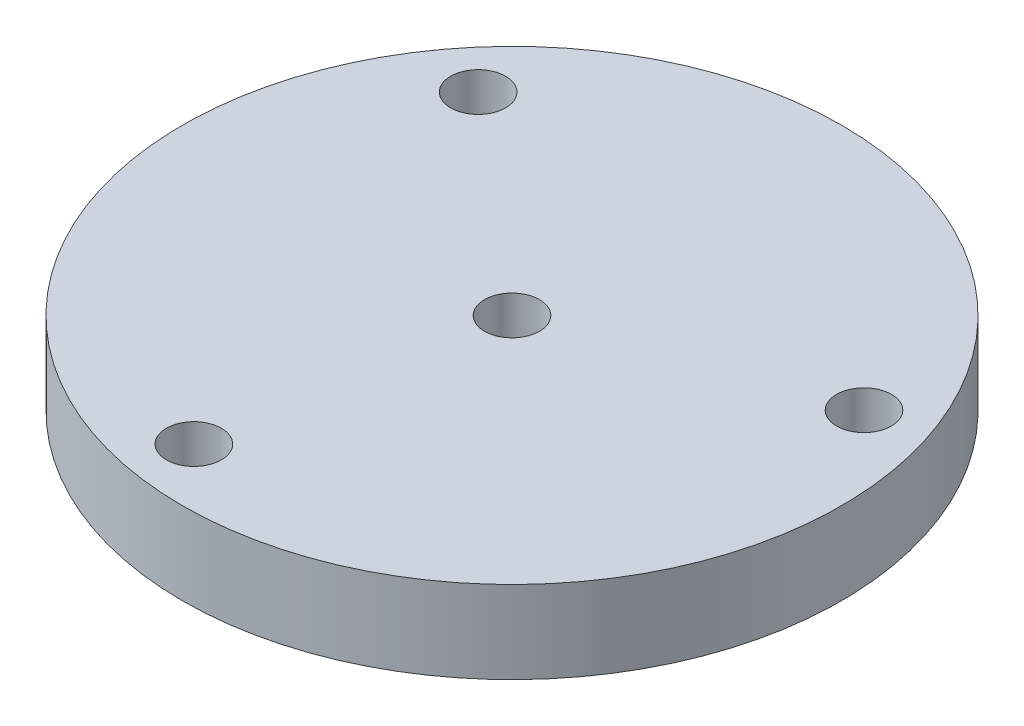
from build123d import *

# Parameters (mm, degrees)
SKETCH_1_W               = 120
SKETCH_1_H               = 30
SKETCH_2_R               = 10
CUT_EXTRUDE_1_DEPTH      = 173.336879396
PATTERN_CIRCULAR_1_COUNT = 3
SKETCH_3_R               = 10
CUT_EXTRUDE_2_DEPTH      = 173.336879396


with BuildPart() as part:
    # Sketch 1 → Revolve 1 (revolve)
    with BuildSketch(Plane.XY, mode=Mode.PRIVATE) as revolve_1_sk:
        with Locations((60, 15)):
            Rectangle(SKETCH_1_W, SKETCH_1_H)
    revolve(revolve_1_sk.sketch.rotate(Axis((0, -34.978212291, 0), (0, 1, 0)), 90), axis=Axis((0, -34.978212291, 0), (0, 1, 0)))

    # Sketch 2 → Cut-Extrude 1 (cut, through all)
    with BuildSketch(Plane(origin=(0, 30, 0), x_dir=(1, 0, 0), z_dir=(0, 1, 0))):
        with Locations(Location((93.969262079, 34.202014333, 0), (0, 0, 270))):
            Circle(SKETCH_2_R)
    cut_extrude_1 = extrude(amount=-CUT_EXTRUDE_1_DEPTH, mode=Mode.SUBTRACT)

    # Pattern Circular 1: Cut-Extrude 1 ×3 about axis
    pattern_circular_1_axis = Axis((0, 0, 0), (0, 1, 0))
    for i in range(1, PATTERN_CIRCULAR_1_COUNT):
        add(cut_extrude_1.rotate(pattern_circular_1_axis, i * 360 / PATTERN_CIRCULAR_1_COUNT), mode=Mode.SUBTRACT)

    # Sketch 3 → Cut-Extrude 2 (cut, through all)
    with BuildSketch(Plane(origin=(0, 30, 0), x_dir=(1, 0, 0), z_dir=(0, 1, 0))):
        with Locations(Location((0, 0, 0), (0, 0, 270))):
            Circle(SKETCH_3_R)
    extrude(amount=-CUT_EXTRUDE_2_DEPTH, mode=Mode.SUBTRACT)


solid = part.part
